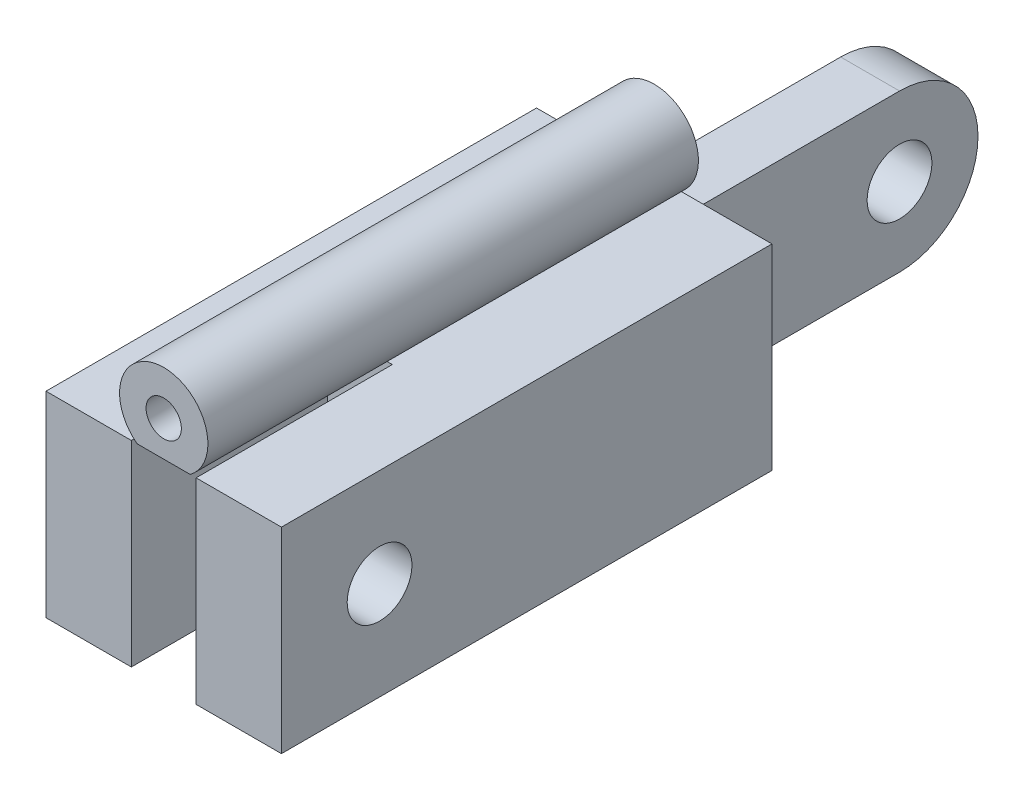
ISO-10303-21;
HEADER;
FILE_DESCRIPTION(('STEP AP214'),'2;1');
FILE_NAME('part.step','',(''),(''),'','','');
FILE_SCHEMA(('AUTOMOTIVE_DESIGN { 1 0 10303 214 1 1 1 1 }'));
ENDSEC;
DATA;
#1=APPLICATION_CONTEXT('core data for automotive mechanical design processes');
#2=APPLICATION_PROTOCOL_DEFINITION('international standard','automotive_design',2000,#1);
#3=PRODUCT_CONTEXT('',#1,'mechanical');
#4=PRODUCT('Part','Part','',(#3));
#5=PRODUCT_RELATED_PRODUCT_CATEGORY('part','',(#4));
#6=PRODUCT_DEFINITION_FORMATION('','',#4);
#7=PRODUCT_DEFINITION_CONTEXT('part definition',#1,'design');
#8=PRODUCT_DEFINITION('design','',#6,#7);
#9=PRODUCT_DEFINITION_SHAPE('','',#8);
#10=(LENGTH_UNIT() NAMED_UNIT(*) SI_UNIT(.MILLI.,.METRE.));
#11=(NAMED_UNIT(*) PLANE_ANGLE_UNIT() SI_UNIT($,.RADIAN.));
#12=(NAMED_UNIT(*) SI_UNIT($,.STERADIAN.) SOLID_ANGLE_UNIT());
#13=UNCERTAINTY_MEASURE_WITH_UNIT(LENGTH_MEASURE(1.E-05),#10,'distance_accuracy_value','');
#14=(GEOMETRIC_REPRESENTATION_CONTEXT(3) GLOBAL_UNCERTAINTY_ASSIGNED_CONTEXT((#13)) GLOBAL_UNIT_ASSIGNED_CONTEXT((#10,
#11,#12)) REPRESENTATION_CONTEXT('',''));
#15=CARTESIAN_POINT('',(0.,0.,0.));
#16=DIRECTION('',(0.,0.,1.));
#17=DIRECTION('',(1.,0.,0.));
#18=AXIS2_PLACEMENT_3D('',#15,#16,#17);
#19=CARTESIAN_POINT('',(0.,10.,0.));
#20=DIRECTION('',(0.,-1.,0.));
#21=DIRECTION('',(0.,0.,-1.));
#22=AXIS2_PLACEMENT_3D('',#19,#20,#21);
#23=PLANE('',#22);
#24=DIRECTION('',(1.,0.,0.));
#25=VECTOR('',#24,1.);
#26=CARTESIAN_POINT('',(4.35,10.,-10.));
#27=LINE('',#26,#25);
#28=CARTESIAN_POINT('',(4.35,10.,-10.));
#29=VERTEX_POINT('',#28);
#30=CARTESIAN_POINT('',(4.65,10.,-10.));
#31=VERTEX_POINT('',#30);
#32=EDGE_CURVE('E273',#29,#31,#27,.T.);
#33=ORIENTED_EDGE('',*,*,#32,.T.);
#34=DIRECTION('',(0.,0.,-1.));
#35=VECTOR('',#34,1.);
#36=CARTESIAN_POINT('',(4.65,10.,0.));
#37=LINE('',#36,#35);
#38=CARTESIAN_POINT('',(4.65,10.,-25.));
#39=VERTEX_POINT('',#38);
#40=EDGE_CURVE('E11',#31,#39,#37,.T.);
#41=ORIENTED_EDGE('',*,*,#40,.T.);
#42=DIRECTION('',(-1.,0.,0.));
#43=VECTOR('',#42,1.);
#44=CARTESIAN_POINT('',(12.,10.,-25.));
#45=LINE('',#44,#43);
#46=CARTESIAN_POINT('',(0.,10.,-25.));
#47=VERTEX_POINT('',#46);
#48=EDGE_CURVE('E285',#39,#47,#45,.T.);
#49=ORIENTED_EDGE('',*,*,#48,.T.);
#50=DIRECTION('',(0.,0.,1.));
#51=VECTOR('',#50,1.);
#52=CARTESIAN_POINT('',(0.,10.,0.));
#53=LINE('',#52,#51);
#54=CARTESIAN_POINT('',(0.,10.,0.));
#55=VERTEX_POINT('',#54);
#56=EDGE_CURVE('E261',#47,#55,#53,.T.);
#57=ORIENTED_EDGE('',*,*,#56,.T.);
#58=DIRECTION('',(1.,0.,0.));
#59=VECTOR('',#58,1.);
#60=CARTESIAN_POINT('',(0.,10.,0.));
#61=LINE('',#60,#59);
#62=CARTESIAN_POINT('',(4.35,10.,0.));
#63=VERTEX_POINT('',#62);
#64=EDGE_CURVE('E265',#55,#63,#61,.T.);
#65=ORIENTED_EDGE('',*,*,#64,.T.);
#66=DIRECTION('',(0.,0.,-1.));
#67=VECTOR('',#66,1.);
#68=CARTESIAN_POINT('',(4.35,10.,0.));
#69=LINE('',#68,#67);
#70=EDGE_CURVE('E269',#63,#29,#69,.T.);
#71=ORIENTED_EDGE('',*,*,#70,.T.);
#72=EDGE_LOOP('',(#33,#41,#49,#57,#65,#71));
#73=FACE_BOUND('',#72,.T.);
#74=ADVANCED_FACE('F45',(#73),#23,.F.);
#75=CARTESIAN_POINT('',(0.,0.,0.));
#76=DIRECTION('',(0.,-1.,0.));
#77=DIRECTION('',(0.,0.,-1.));
#78=AXIS2_PLACEMENT_3D('',#75,#76,#77);
#79=PLANE('',#78);
#80=DIRECTION('',(0.,0.,-1.));
#81=VECTOR('',#80,1.);
#82=CARTESIAN_POINT('',(4.65,0.,-10.));
#83=LINE('',#82,#81);
#84=CARTESIAN_POINT('',(4.65,0.,-10.));
#85=VERTEX_POINT('',#84);
#86=CARTESIAN_POINT('',(4.65,0.,-25.));
#87=VERTEX_POINT('',#86);
#88=EDGE_CURVE('E205',#85,#87,#83,.T.);
#89=ORIENTED_EDGE('',*,*,#88,.F.);
#90=DIRECTION('',(1.,0.,0.));
#91=VECTOR('',#90,1.);
#92=CARTESIAN_POINT('',(4.35,0.,-10.));
#93=LINE('',#92,#91);
#94=CARTESIAN_POINT('',(4.35,0.,-10.));
#95=VERTEX_POINT('',#94);
#96=EDGE_CURVE('E300',#95,#85,#93,.T.);
#97=ORIENTED_EDGE('',*,*,#96,.F.);
#98=DIRECTION('',(0.,0.,-1.));
#99=VECTOR('',#98,1.);
#100=CARTESIAN_POINT('',(4.35,0.,0.));
#101=LINE('',#100,#99);
#102=CARTESIAN_POINT('',(4.35,0.,0.));
#103=VERTEX_POINT('',#102);
#104=EDGE_CURVE('E296',#103,#95,#101,.T.);
#105=ORIENTED_EDGE('',*,*,#104,.F.);
#106=DIRECTION('',(1.,0.,0.));
#107=VECTOR('',#106,1.);
#108=CARTESIAN_POINT('',(0.,0.,0.));
#109=LINE('',#108,#107);
#110=CARTESIAN_POINT('',(0.,0.,0.));
#111=VERTEX_POINT('',#110);
#112=EDGE_CURVE('E293',#111,#103,#109,.T.);
#113=ORIENTED_EDGE('',*,*,#112,.F.);
#114=DIRECTION('',(0.,0.,1.));
#115=VECTOR('',#114,1.);
#116=CARTESIAN_POINT('',(0.,0.,0.));
#117=LINE('',#116,#115);
#118=CARTESIAN_POINT('',(0.,0.,-25.));
#119=VERTEX_POINT('',#118);
#120=EDGE_CURVE('E260',#119,#111,#117,.T.);
#121=ORIENTED_EDGE('',*,*,#120,.F.);
#122=DIRECTION('',(-1.,0.,0.));
#123=VECTOR('',#122,1.);
#124=CARTESIAN_POINT('',(0.,0.,-25.));
#125=LINE('',#124,#123);
#126=EDGE_CURVE('E314',#87,#119,#125,.T.);
#127=ORIENTED_EDGE('',*,*,#126,.F.);
#128=EDGE_LOOP('',(#89,#97,#105,#113,#121,#127));
#129=FACE_BOUND('',#128,.T.);
#130=ADVANCED_FACE('F420',(#129),#79,.T.);
#131=CARTESIAN_POINT('',(7.5,10.,-40.));
#132=DIRECTION('',(-1.,0.,0.));
#133=DIRECTION('',(0.,0.,1.));
#134=AXIS2_PLACEMENT_3D('',#131,#132,#133);
#135=PLANE('',#134);
#136=CARTESIAN_POINT('',(7.5,5.,-36.));
#137=DIRECTION('',(-1.,0.,0.));
#138=DIRECTION('',(0.,0.,1.));
#139=AXIS2_PLACEMENT_3D('',#136,#137,#138);
#140=CIRCLE('',#139,1.65);
#141=CARTESIAN_POINT('',(7.5,5.,-34.35));
#142=VERTEX_POINT('',#141);
#143=EDGE_CURVE('E236',#142,#142,#140,.T.);
#144=ORIENTED_EDGE('',*,*,#143,.T.);
#145=EDGE_LOOP('',(#144));
#146=FACE_BOUND('',#145,.T.);
#147=CARTESIAN_POINT('',(7.5,5.,-36.));
#148=DIRECTION('',(-1.,0.,0.));
#149=DIRECTION('',(0.,0.,1.));
#150=AXIS2_PLACEMENT_3D('',#147,#148,#149);
#151=CIRCLE('',#150,4.);
#152=CARTESIAN_POINT('',(7.5,1.,-36.));
#153=VERTEX_POINT('',#152);
#154=CARTESIAN_POINT('',(7.5,5.,-40.));
#155=VERTEX_POINT('',#154);
#156=EDGE_CURVE('E367',#153,#155,#151,.F.);
#157=ORIENTED_EDGE('',*,*,#156,.T.);
#158=CARTESIAN_POINT('',(7.5,5.,-36.));
#159=DIRECTION('',(-1.,0.,0.));
#160=DIRECTION('',(0.,0.,1.));
#161=AXIS2_PLACEMENT_3D('',#158,#159,#160);
#162=CIRCLE('',#161,4.);
#163=CARTESIAN_POINT('',(7.5,9.,-36.));
#164=VERTEX_POINT('',#163);
#165=EDGE_CURVE('E370',#155,#164,#162,.F.);
#166=ORIENTED_EDGE('',*,*,#165,.T.);
#167=DIRECTION('',(0.,0.,-1.));
#168=VECTOR('',#167,1.);
#169=CARTESIAN_POINT('',(7.5,9.,-40.));
#170=LINE('',#169,#168);
#171=CARTESIAN_POINT('',(7.5,9.,-25.));
#172=VERTEX_POINT('',#171);
#173=EDGE_CURVE('E256',#172,#164,#170,.T.);
#174=ORIENTED_EDGE('',*,*,#173,.F.);
#175=DIRECTION('',(0.,-1.,0.));
#176=VECTOR('',#175,1.);
#177=CARTESIAN_POINT('',(7.5,10.,-25.));
#178=LINE('',#177,#176);
#179=CARTESIAN_POINT('',(7.5,1.,-25.));
#180=VERTEX_POINT('',#179);
#181=EDGE_CURVE('E325',#172,#180,#178,.T.);
#182=ORIENTED_EDGE('',*,*,#181,.T.);
#183=DIRECTION('',(0.,0.,1.));
#184=VECTOR('',#183,1.);
#185=CARTESIAN_POINT('',(7.5,1.,-25.));
#186=LINE('',#185,#184);
#187=EDGE_CURVE('E244',#153,#180,#186,.T.);
#188=ORIENTED_EDGE('',*,*,#187,.F.);
#189=EDGE_LOOP('',(#157,#166,#174,#182,#188));
#190=FACE_BOUND('',#189,.T.);
#191=ADVANCED_FACE('F451',(#146,#190),#135,.F.);
#192=CARTESIAN_POINT('',(4.5,10.,-40.));
#193=DIRECTION('',(1.,0.,0.));
#194=DIRECTION('',(0.,0.,-1.));
#195=AXIS2_PLACEMENT_3D('',#192,#193,#194);
#196=PLANE('',#195);
#197=CARTESIAN_POINT('',(4.5,5.,-36.));
#198=DIRECTION('',(-1.,0.,0.));
#199=DIRECTION('',(0.,0.,1.));
#200=AXIS2_PLACEMENT_3D('',#197,#198,#199);
#201=CIRCLE('',#200,1.65);
#202=CARTESIAN_POINT('',(4.5,5.,-34.35));
#203=VERTEX_POINT('',#202);
#204=EDGE_CURVE('E232',#203,#203,#201,.T.);
#205=ORIENTED_EDGE('',*,*,#204,.F.);
#206=EDGE_LOOP('',(#205));
#207=FACE_BOUND('',#206,.T.);
#208=DIRECTION('',(0.,0.,1.));
#209=VECTOR('',#208,1.);
#210=CARTESIAN_POINT('',(4.5,9.,-40.));
#211=LINE('',#210,#209);
#212=CARTESIAN_POINT('',(4.5,9.,-36.));
#213=VERTEX_POINT('',#212);
#214=CARTESIAN_POINT('',(4.5,9.,-25.));
#215=VERTEX_POINT('',#214);
#216=EDGE_CURVE('E250',#213,#215,#211,.T.);
#217=ORIENTED_EDGE('',*,*,#216,.F.);
#218=CARTESIAN_POINT('',(4.5,5.,-36.));
#219=DIRECTION('',(1.,0.,0.));
#220=DIRECTION('',(0.,0.,-1.));
#221=AXIS2_PLACEMENT_3D('',#218,#219,#220);
#222=CIRCLE('',#221,4.);
#223=CARTESIAN_POINT('',(4.5,5.,-40.));
#224=VERTEX_POINT('',#223);
#225=EDGE_CURVE('E364',#213,#224,#222,.F.);
#226=ORIENTED_EDGE('',*,*,#225,.T.);
#227=CARTESIAN_POINT('',(4.5,5.,-36.));
#228=DIRECTION('',(1.,0.,0.));
#229=DIRECTION('',(0.,0.,-1.));
#230=AXIS2_PLACEMENT_3D('',#227,#228,#229);
#231=CIRCLE('',#230,4.);
#232=CARTESIAN_POINT('',(4.5,1.,-36.));
#233=VERTEX_POINT('',#232);
#234=EDGE_CURVE('E361',#224,#233,#231,.F.);
#235=ORIENTED_EDGE('',*,*,#234,.T.);
#236=DIRECTION('',(0.,0.,-1.));
#237=VECTOR('',#236,1.);
#238=CARTESIAN_POINT('',(4.5,1.,-25.));
#239=LINE('',#238,#237);
#240=CARTESIAN_POINT('',(4.5,1.,-25.));
#241=VERTEX_POINT('',#240);
#242=EDGE_CURVE('E240',#241,#233,#239,.T.);
#243=ORIENTED_EDGE('',*,*,#242,.F.);
#244=DIRECTION('',(0.,-1.,0.));
#245=VECTOR('',#244,1.);
#246=CARTESIAN_POINT('',(4.5,10.,-25.));
#247=LINE('',#246,#245);
#248=EDGE_CURVE('E321',#215,#241,#247,.T.);
#249=ORIENTED_EDGE('',*,*,#248,.F.);
#250=EDGE_LOOP('',(#217,#226,#235,#243,#249));
#251=FACE_BOUND('',#250,.T.);
#252=ADVANCED_FACE('F471',(#207,#251),#196,.F.);
#253=CARTESIAN_POINT('',(0.,10.,0.));
#254=DIRECTION('',(1.,0.,0.));
#255=DIRECTION('',(0.,0.,-1.));
#256=AXIS2_PLACEMENT_3D('',#253,#254,#255);
#257=PLANE('',#256);
#258=CARTESIAN_POINT('',(0.,5.,-5.));
#259=DIRECTION('',(-1.,0.,0.));
#260=DIRECTION('',(0.,0.,1.));
#261=AXIS2_PLACEMENT_3D('',#258,#259,#260);
#262=CIRCLE('',#261,1.65);
#263=CARTESIAN_POINT('',(0.,5.,-3.35));
#264=VERTEX_POINT('',#263);
#265=EDGE_CURVE('E212',#264,#264,#262,.T.);
#266=ORIENTED_EDGE('',*,*,#265,.F.);
#267=EDGE_LOOP('',(#266));
#268=FACE_BOUND('',#267,.T.);
#269=ORIENTED_EDGE('',*,*,#120,.T.);
#270=DIRECTION('',(0.,-1.,0.));
#271=VECTOR('',#270,1.);
#272=CARTESIAN_POINT('',(0.,10.,0.));
#273=LINE('',#272,#271);
#274=EDGE_CURVE('E353',#55,#111,#273,.T.);
#275=ORIENTED_EDGE('',*,*,#274,.F.);
#276=ORIENTED_EDGE('',*,*,#56,.F.);
#277=DIRECTION('',(0.,-1.,0.));
#278=VECTOR('',#277,1.);
#279=CARTESIAN_POINT('',(0.,10.,-25.));
#280=LINE('',#279,#278);
#281=EDGE_CURVE('E289',#47,#119,#280,.T.);
#282=ORIENTED_EDGE('',*,*,#281,.T.);
#283=EDGE_LOOP('',(#269,#275,#276,#282));
#284=FACE_BOUND('',#283,.T.);
#285=ADVANCED_FACE('F426',(#268,#284),#257,.F.);
#286=CARTESIAN_POINT('',(0.,10.,0.));
#287=DIRECTION('',(0.,0.,-1.));
#288=DIRECTION('',(-1.,0.,0.));
#289=AXIS2_PLACEMENT_3D('',#286,#287,#288);
#290=PLANE('',#289);
#291=ORIENTED_EDGE('',*,*,#112,.T.);
#292=DIRECTION('',(0.,-1.,0.));
#293=VECTOR('',#292,1.);
#294=CARTESIAN_POINT('',(4.35,10.,0.));
#295=LINE('',#294,#293);
#296=EDGE_CURVE('E349',#63,#103,#295,.T.);
#297=ORIENTED_EDGE('',*,*,#296,.F.);
#298=ORIENTED_EDGE('',*,*,#64,.F.);
#299=ORIENTED_EDGE('',*,*,#274,.T.);
#300=EDGE_LOOP('',(#291,#297,#298,#299));
#301=FACE_BOUND('',#300,.T.);
#302=ADVANCED_FACE('F430',(#301),#290,.F.);
#303=CARTESIAN_POINT('',(4.35,10.,0.));
#304=DIRECTION('',(-1.,0.,0.));
#305=DIRECTION('',(0.,0.,1.));
#306=AXIS2_PLACEMENT_3D('',#303,#304,#305);
#307=PLANE('',#306);
#308=CARTESIAN_POINT('',(4.35,5.,-5.));
#309=DIRECTION('',(-1.,0.,0.));
#310=DIRECTION('',(0.,0.,1.));
#311=AXIS2_PLACEMENT_3D('',#308,#309,#310);
#312=CIRCLE('',#311,1.65);
#313=CARTESIAN_POINT('',(4.35,5.,-3.35));
#314=VERTEX_POINT('',#313);
#315=EDGE_CURVE('E227',#314,#314,#312,.T.);
#316=ORIENTED_EDGE('',*,*,#315,.T.);
#317=EDGE_LOOP('',(#316));
#318=FACE_BOUND('',#317,.T.);
#319=ORIENTED_EDGE('',*,*,#104,.T.);
#320=DIRECTION('',(0.,-1.,0.));
#321=VECTOR('',#320,1.);
#322=CARTESIAN_POINT('',(4.35,10.,-10.));
#323=LINE('',#322,#321);
#324=EDGE_CURVE('E345',#29,#95,#323,.T.);
#325=ORIENTED_EDGE('',*,*,#324,.F.);
#326=ORIENTED_EDGE('',*,*,#70,.F.);
#327=ORIENTED_EDGE('',*,*,#296,.T.);
#328=EDGE_LOOP('',(#319,#325,#326,#327));
#329=FACE_BOUND('',#328,.T.);
#330=ADVANCED_FACE('F431',(#318,#329),#307,.F.);
#331=CARTESIAN_POINT('',(4.35,10.,-10.));
#332=DIRECTION('',(0.,0.,-1.));
#333=DIRECTION('',(-1.,0.,0.));
#334=AXIS2_PLACEMENT_3D('',#331,#332,#333);
#335=PLANE('',#334);
#336=CARTESIAN_POINT('',(6.,-1.8,-10.));
#337=DIRECTION('',(0.,0.,-1.));
#338=DIRECTION('',(-1.,0.,0.));
#339=AXIS2_PLACEMENT_3D('',#336,#337,#338);
#340=CIRCLE('',#339,0.899999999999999);
#341=CARTESIAN_POINT('',(5.1,-1.8,-10.));
#342=VERTEX_POINT('',#341);
#343=EDGE_CURVE('E198',#342,#342,#340,.T.);
#344=ORIENTED_EDGE('',*,*,#343,.T.);
#345=EDGE_LOOP('',(#344));
#346=FACE_BOUND('',#345,.T.);
#347=ORIENTED_EDGE('',*,*,#96,.T.);
#348=CARTESIAN_POINT('',(6.,-1.8,-10.));
#349=DIRECTION('',(0.,0.,-1.));
#350=DIRECTION('',(-1.,0.,0.));
#351=AXIS2_PLACEMENT_3D('',#348,#349,#350);
#352=CIRCLE('',#351,2.25);
#353=CARTESIAN_POINT('',(7.35,0.,-10.));
#354=VERTEX_POINT('',#353);
#355=EDGE_CURVE('E202',#354,#85,#352,.T.);
#356=ORIENTED_EDGE('',*,*,#355,.F.);
#357=CARTESIAN_POINT('',(7.65,0.,-10.));
#358=VERTEX_POINT('',#357);
#359=EDGE_CURVE('E299',#354,#358,#93,.T.);
#360=ORIENTED_EDGE('',*,*,#359,.T.);
#361=DIRECTION('',(0.,-1.,0.));
#362=VECTOR('',#361,1.);
#363=CARTESIAN_POINT('',(7.65,10.,-10.));
#364=LINE('',#363,#362);
#365=CARTESIAN_POINT('',(7.65,10.,-10.));
#366=VERTEX_POINT('',#365);
#367=EDGE_CURVE('E341',#366,#358,#364,.T.);
#368=ORIENTED_EDGE('',*,*,#367,.F.);
#369=CARTESIAN_POINT('',(7.35,10.,-10.));
#370=VERTEX_POINT('',#369);
#371=EDGE_CURVE('E272',#370,#366,#27,.T.);
#372=ORIENTED_EDGE('',*,*,#371,.F.);
#373=EDGE_CURVE('E67',#31,#370,#27,.T.);
#374=ORIENTED_EDGE('',*,*,#373,.F.);
#375=ORIENTED_EDGE('',*,*,#32,.F.);
#376=ORIENTED_EDGE('',*,*,#324,.T.);
#377=EDGE_LOOP('',(#347,#356,#360,#368,#372,#374,#375,#376));
#378=FACE_BOUND('',#377,.T.);
#379=ADVANCED_FACE('F387',(#346,#378),#335,.F.);
#380=CARTESIAN_POINT('',(7.65,10.,0.));
#381=DIRECTION('',(1.,0.,0.));
#382=DIRECTION('',(0.,0.,-1.));
#383=AXIS2_PLACEMENT_3D('',#380,#381,#382);
#384=PLANE('',#383);
#385=CARTESIAN_POINT('',(7.65,5.,-5.));
#386=DIRECTION('',(1.,0.,0.));
#387=DIRECTION('',(0.,0.,-1.));
#388=AXIS2_PLACEMENT_3D('',#385,#386,#387);
#389=CIRCLE('',#388,1.65);
#390=CARTESIAN_POINT('',(7.65,5.,-3.35));
#391=VERTEX_POINT('',#390);
#392=EDGE_CURVE('E220',#391,#391,#389,.T.);
#393=ORIENTED_EDGE('',*,*,#392,.T.);
#394=EDGE_LOOP('',(#393));
#395=FACE_BOUND('',#394,.T.);
#396=DIRECTION('',(0.,0.,1.));
#397=VECTOR('',#396,1.);
#398=CARTESIAN_POINT('',(7.65,0.,0.));
#399=LINE('',#398,#397);
#400=CARTESIAN_POINT('',(7.65,0.,0.));
#401=VERTEX_POINT('',#400);
#402=EDGE_CURVE('E304',#358,#401,#399,.T.);
#403=ORIENTED_EDGE('',*,*,#402,.T.);
#404=DIRECTION('',(0.,-1.,0.));
#405=VECTOR('',#404,1.);
#406=CARTESIAN_POINT('',(7.65,10.,0.));
#407=LINE('',#406,#405);
#408=CARTESIAN_POINT('',(7.65,10.,0.));
#409=VERTEX_POINT('',#408);
#410=EDGE_CURVE('E337',#409,#401,#407,.T.);
#411=ORIENTED_EDGE('',*,*,#410,.F.);
#412=DIRECTION('',(0.,0.,1.));
#413=VECTOR('',#412,1.);
#414=CARTESIAN_POINT('',(7.65,10.,0.));
#415=LINE('',#414,#413);
#416=EDGE_CURVE('E276',#366,#409,#415,.T.);
#417=ORIENTED_EDGE('',*,*,#416,.F.);
#418=ORIENTED_EDGE('',*,*,#367,.T.);
#419=EDGE_LOOP('',(#403,#411,#417,#418));
#420=FACE_BOUND('',#419,.T.);
#421=ADVANCED_FACE('F392',(#395,#420),#384,.F.);
#422=CARTESIAN_POINT('',(7.65,10.,0.));
#423=DIRECTION('',(0.,0.,-1.));
#424=DIRECTION('',(-1.,0.,0.));
#425=AXIS2_PLACEMENT_3D('',#422,#423,#424);
#426=PLANE('',#425);
#427=DIRECTION('',(1.,0.,0.));
#428=VECTOR('',#427,1.);
#429=CARTESIAN_POINT('',(7.65,0.,0.));
#430=LINE('',#429,#428);
#431=CARTESIAN_POINT('',(12.,0.,0.));
#432=VERTEX_POINT('',#431);
#433=EDGE_CURVE('E307',#401,#432,#430,.T.);
#434=ORIENTED_EDGE('',*,*,#433,.T.);
#435=DIRECTION('',(0.,-1.,0.));
#436=VECTOR('',#435,1.);
#437=CARTESIAN_POINT('',(12.,10.,0.));
#438=LINE('',#437,#436);
#439=CARTESIAN_POINT('',(12.,10.,0.));
#440=VERTEX_POINT('',#439);
#441=EDGE_CURVE('E333',#440,#432,#438,.T.);
#442=ORIENTED_EDGE('',*,*,#441,.F.);
#443=DIRECTION('',(1.,0.,0.));
#444=VECTOR('',#443,1.);
#445=CARTESIAN_POINT('',(7.65,10.,0.));
#446=LINE('',#445,#444);
#447=EDGE_CURVE('E279',#409,#440,#446,.T.);
#448=ORIENTED_EDGE('',*,*,#447,.F.);
#449=ORIENTED_EDGE('',*,*,#410,.T.);
#450=EDGE_LOOP('',(#434,#442,#448,#449));
#451=FACE_BOUND('',#450,.T.);
#452=ADVANCED_FACE('F399',(#451),#426,.F.);
#453=CARTESIAN_POINT('',(12.,10.,0.));
#454=DIRECTION('',(-1.,0.,0.));
#455=DIRECTION('',(0.,0.,1.));
#456=AXIS2_PLACEMENT_3D('',#453,#454,#455);
#457=PLANE('',#456);
#458=CARTESIAN_POINT('',(12.,5.,-5.));
#459=DIRECTION('',(-1.,0.,0.));
#460=DIRECTION('',(0.,0.,1.));
#461=AXIS2_PLACEMENT_3D('',#458,#459,#460);
#462=CIRCLE('',#461,1.65);
#463=CARTESIAN_POINT('',(12.,5.,-3.35));
#464=VERTEX_POINT('',#463);
#465=EDGE_CURVE('E216',#464,#464,#462,.T.);
#466=ORIENTED_EDGE('',*,*,#465,.T.);
#467=EDGE_LOOP('',(#466));
#468=FACE_BOUND('',#467,.T.);
#469=DIRECTION('',(0.,0.,-1.));
#470=VECTOR('',#469,1.);
#471=CARTESIAN_POINT('',(12.,0.,0.));
#472=LINE('',#471,#470);
#473=CARTESIAN_POINT('',(12.,0.,-25.));
#474=VERTEX_POINT('',#473);
#475=EDGE_CURVE('E310',#432,#474,#472,.T.);
#476=ORIENTED_EDGE('',*,*,#475,.T.);
#477=DIRECTION('',(0.,-1.,0.));
#478=VECTOR('',#477,1.);
#479=CARTESIAN_POINT('',(12.,10.,-25.));
#480=LINE('',#479,#478);
#481=CARTESIAN_POINT('',(12.,10.,-25.));
#482=VERTEX_POINT('',#481);
#483=EDGE_CURVE('E329',#482,#474,#480,.T.);
#484=ORIENTED_EDGE('',*,*,#483,.F.);
#485=DIRECTION('',(0.,0.,-1.));
#486=VECTOR('',#485,1.);
#487=CARTESIAN_POINT('',(12.,10.,0.));
#488=LINE('',#487,#486);
#489=EDGE_CURVE('E282',#440,#482,#488,.T.);
#490=ORIENTED_EDGE('',*,*,#489,.F.);
#491=ORIENTED_EDGE('',*,*,#441,.T.);
#492=EDGE_LOOP('',(#476,#484,#490,#491));
#493=FACE_BOUND('',#492,.T.);
#494=ADVANCED_FACE('F403',(#468,#493),#457,.F.);
#495=CARTESIAN_POINT('',(0.,10.,-25.));
#496=DIRECTION('',(0.,0.,1.));
#497=DIRECTION('',(1.,0.,0.));
#498=AXIS2_PLACEMENT_3D('',#495,#496,#497);
#499=PLANE('',#498);
#500=CARTESIAN_POINT('',(6.,11.8,-25.));
#501=DIRECTION('',(0.,0.,-1.));
#502=DIRECTION('',(-1.,0.,0.));
#503=AXIS2_PLACEMENT_3D('',#500,#501,#502);
#504=CIRCLE('',#503,0.899999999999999);
#505=CARTESIAN_POINT('',(5.1,11.8,-25.));
#506=VERTEX_POINT('',#505);
#507=EDGE_CURVE('E676',#506,#506,#504,.T.);
#508=ORIENTED_EDGE('',*,*,#507,.F.);
#509=EDGE_LOOP('',(#508));
#510=FACE_BOUND('',#509,.T.);
#511=CARTESIAN_POINT('',(6.,-1.8,-25.));
#512=DIRECTION('',(0.,0.,-1.));
#513=DIRECTION('',(-1.,0.,0.));
#514=AXIS2_PLACEMENT_3D('',#511,#512,#513);
#515=CIRCLE('',#514,0.899999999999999);
#516=CARTESIAN_POINT('',(5.1,-1.8,-25.));
#517=VERTEX_POINT('',#516);
#518=EDGE_CURVE('E669',#517,#517,#515,.T.);
#519=ORIENTED_EDGE('',*,*,#518,.F.);
#520=EDGE_LOOP('',(#519));
#521=FACE_BOUND('',#520,.T.);
#522=ORIENTED_EDGE('',*,*,#483,.T.);
#523=CARTESIAN_POINT('',(7.35,0.,-25.));
#524=VERTEX_POINT('',#523);
#525=EDGE_CURVE('E266',#474,#524,#125,.T.);
#526=ORIENTED_EDGE('',*,*,#525,.T.);
#527=CARTESIAN_POINT('',(6.,-1.8,-25.));
#528=DIRECTION('',(0.,0.,-1.));
#529=DIRECTION('',(-1.,0.,0.));
#530=AXIS2_PLACEMENT_3D('',#527,#528,#529);
#531=CIRCLE('',#530,2.25);
#532=EDGE_CURVE('E200',#524,#87,#531,.T.);
#533=ORIENTED_EDGE('',*,*,#532,.T.);
#534=ORIENTED_EDGE('',*,*,#126,.T.);
#535=ORIENTED_EDGE('',*,*,#281,.F.);
#536=ORIENTED_EDGE('',*,*,#48,.F.);
#537=CARTESIAN_POINT('',(6.,11.8,-25.));
#538=DIRECTION('',(0.,0.,-1.));
#539=DIRECTION('',(-1.,0.,0.));
#540=AXIS2_PLACEMENT_3D('',#537,#538,#539);
#541=CIRCLE('',#540,2.25);
#542=CARTESIAN_POINT('',(7.35,10.,-25.));
#543=VERTEX_POINT('',#542);
#544=EDGE_CURVE('E188',#39,#543,#541,.T.);
#545=ORIENTED_EDGE('',*,*,#544,.T.);
#546=EDGE_CURVE('E286',#482,#543,#45,.T.);
#547=ORIENTED_EDGE('',*,*,#546,.F.);
#548=EDGE_LOOP('',(#522,#526,#533,#534,#535,#536,#545,#547));
#549=FACE_BOUND('',#548,.T.);
#550=ORIENTED_EDGE('',*,*,#248,.T.);
#551=DIRECTION('',(-1.,0.,0.));
#552=VECTOR('',#551,1.);
#553=CARTESIAN_POINT('',(4.5,1.,-25.));
#554=LINE('',#553,#552);
#555=EDGE_CURVE('E247',#180,#241,#554,.T.);
#556=ORIENTED_EDGE('',*,*,#555,.F.);
#557=ORIENTED_EDGE('',*,*,#181,.F.);
#558=DIRECTION('',(1.,0.,0.));
#559=VECTOR('',#558,1.);
#560=CARTESIAN_POINT('',(4.5,9.,-25.));
#561=LINE('',#560,#559);
#562=EDGE_CURVE('E253',#215,#172,#561,.T.);
#563=ORIENTED_EDGE('',*,*,#562,.F.);
#564=EDGE_LOOP('',(#550,#556,#557,#563));
#565=FACE_BOUND('',#564,.T.);
#566=ADVANCED_FACE('F408',(#510,#521,#549,#565),#499,.F.);
#567=ORIENTED_EDGE('',*,*,#546,.T.);
#568=DIRECTION('',(0.,0.,-1.));
#569=VECTOR('',#568,1.);
#570=CARTESIAN_POINT('',(7.35,10.,0.));
#571=LINE('',#570,#569);
#572=EDGE_CURVE('E54',#543,#370,#571,.F.);
#573=ORIENTED_EDGE('',*,*,#572,.T.);
#574=ORIENTED_EDGE('',*,*,#371,.T.);
#575=ORIENTED_EDGE('',*,*,#416,.T.);
#576=ORIENTED_EDGE('',*,*,#447,.T.);
#577=ORIENTED_EDGE('',*,*,#489,.T.);
#578=EDGE_LOOP('',(#567,#573,#574,#575,#576,#577));
#579=FACE_BOUND('',#578,.T.);
#580=ADVANCED_FACE('F406',(#579),#23,.F.);
#581=DIRECTION('',(0.,0.,-1.));
#582=VECTOR('',#581,1.);
#583=CARTESIAN_POINT('',(7.35,0.,-10.));
#584=LINE('',#583,#582);
#585=EDGE_CURVE('E208',#354,#524,#584,.T.);
#586=ORIENTED_EDGE('',*,*,#585,.T.);
#587=ORIENTED_EDGE('',*,*,#525,.F.);
#588=ORIENTED_EDGE('',*,*,#475,.F.);
#589=ORIENTED_EDGE('',*,*,#433,.F.);
#590=ORIENTED_EDGE('',*,*,#402,.F.);
#591=ORIENTED_EDGE('',*,*,#359,.F.);
#592=EDGE_LOOP('',(#586,#587,#588,#589,#590,#591));
#593=FACE_BOUND('',#592,.T.);
#594=ADVANCED_FACE('F395',(#593),#79,.T.);
#595=CARTESIAN_POINT('',(0.,9.,0.));
#596=DIRECTION('',(0.,1.,0.));
#597=DIRECTION('',(0.,0.,1.));
#598=AXIS2_PLACEMENT_3D('',#595,#596,#597);
#599=PLANE('',#598);
#600=ORIENTED_EDGE('',*,*,#173,.T.);
#601=DIRECTION('',(-1.,0.,0.));
#602=VECTOR('',#601,1.);
#603=CARTESIAN_POINT('',(4.5,9.,-36.));
#604=LINE('',#603,#602);
#605=EDGE_CURVE('E357',#164,#213,#604,.T.);
#606=ORIENTED_EDGE('',*,*,#605,.T.);
#607=ORIENTED_EDGE('',*,*,#216,.T.);
#608=ORIENTED_EDGE('',*,*,#562,.T.);
#609=EDGE_LOOP('',(#600,#606,#607,#608));
#610=FACE_BOUND('',#609,.T.);
#611=ADVANCED_FACE('F458',(#610),#599,.T.);
#612=CARTESIAN_POINT('',(0.,1.,0.));
#613=DIRECTION('',(0.,-1.,0.));
#614=DIRECTION('',(0.,0.,-1.));
#615=AXIS2_PLACEMENT_3D('',#612,#613,#614);
#616=PLANE('',#615);
#617=ORIENTED_EDGE('',*,*,#242,.T.);
#618=DIRECTION('',(1.,0.,0.));
#619=VECTOR('',#618,1.);
#620=CARTESIAN_POINT('',(7.5,1.,-36.));
#621=LINE('',#620,#619);
#622=EDGE_CURVE('E373',#233,#153,#621,.T.);
#623=ORIENTED_EDGE('',*,*,#622,.T.);
#624=ORIENTED_EDGE('',*,*,#187,.T.);
#625=ORIENTED_EDGE('',*,*,#555,.T.);
#626=EDGE_LOOP('',(#617,#623,#624,#625));
#627=FACE_BOUND('',#626,.T.);
#628=ADVANCED_FACE('F504',(#627),#616,.T.);
#629=CARTESIAN_POINT('',(14.5,5.,-36.));
#630=DIRECTION('',(-1.,0.,0.));
#631=DIRECTION('',(0.,0.,1.));
#632=AXIS2_PLACEMENT_3D('',#629,#630,#631);
#633=CYLINDRICAL_SURFACE('',#632,1.65);
#634=ORIENTED_EDGE('',*,*,#204,.T.);
#635=EDGE_LOOP('',(#634));
#636=FACE_BOUND('',#635,.T.);
#637=ORIENTED_EDGE('',*,*,#143,.F.);
#638=EDGE_LOOP('',(#637));
#639=FACE_BOUND('',#638,.T.);
#640=ADVANCED_FACE('F501',(#636,#639),#633,.F.);
#641=CARTESIAN_POINT('',(0.,5.,-36.));
#642=DIRECTION('',(-1.,0.,0.));
#643=DIRECTION('',(0.,0.,1.));
#644=AXIS2_PLACEMENT_3D('',#641,#642,#643);
#645=CYLINDRICAL_SURFACE('',#644,4.);
#646=DIRECTION('',(1.,0.,0.));
#647=VECTOR('',#646,1.);
#648=CARTESIAN_POINT('',(4.5,5.,-40.));
#649=LINE('',#648,#647);
#650=EDGE_CURVE('E231',#155,#224,#649,.F.);
#651=ORIENTED_EDGE('',*,*,#650,.F.);
#652=ORIENTED_EDGE('',*,*,#156,.F.);
#653=ORIENTED_EDGE('',*,*,#622,.F.);
#654=ORIENTED_EDGE('',*,*,#234,.F.);
#655=EDGE_LOOP('',(#651,#652,#653,#654));
#656=FACE_BOUND('',#655,.T.);
#657=ADVANCED_FACE('F47',(#656),#645,.T.);
#658=CARTESIAN_POINT('',(0.,5.,-36.));
#659=DIRECTION('',(1.,0.,0.));
#660=DIRECTION('',(0.,0.,-1.));
#661=AXIS2_PLACEMENT_3D('',#658,#659,#660);
#662=CYLINDRICAL_SURFACE('',#661,4.);
#663=ORIENTED_EDGE('',*,*,#165,.F.);
#664=ORIENTED_EDGE('',*,*,#650,.T.);
#665=ORIENTED_EDGE('',*,*,#225,.F.);
#666=ORIENTED_EDGE('',*,*,#605,.F.);
#667=EDGE_LOOP('',(#663,#664,#665,#666));
#668=FACE_BOUND('',#667,.T.);
#669=ADVANCED_FACE('F488',(#668),#662,.T.);
#670=CARTESIAN_POINT('',(12.,5.,-5.));
#671=DIRECTION('',(-1.,0.,0.));
#672=DIRECTION('',(0.,0.,1.));
#673=AXIS2_PLACEMENT_3D('',#670,#671,#672);
#674=CYLINDRICAL_SURFACE('',#673,1.65);
#675=CARTESIAN_POINT('',(12.,5.,-3.35));
#676=CARTESIAN_POINT('',(11.9546875,5.,-3.35));
#677=CARTESIAN_POINT('',(11.909375,5.,-3.35));
#678=CARTESIAN_POINT('',(11.81875,5.,-3.35));
#679=CARTESIAN_POINT('',(11.7734375,5.,-3.35));
#680=CARTESIAN_POINT('',(11.6828125,5.,-3.35));
#681=CARTESIAN_POINT('',(11.6375,5.,-3.35));
#682=CARTESIAN_POINT('',(11.546875,5.,-3.35));
#683=CARTESIAN_POINT('',(11.5015625,5.,-3.35));
#684=CARTESIAN_POINT('',(11.4109375,5.,-3.35));
#685=CARTESIAN_POINT('',(11.365625,5.,-3.35));
#686=CARTESIAN_POINT('',(11.275,5.,-3.35));
#687=CARTESIAN_POINT('',(11.2296875,5.,-3.35));
#688=CARTESIAN_POINT('',(11.1390625,5.,-3.35));
#689=CARTESIAN_POINT('',(11.09375,5.,-3.35));
#690=CARTESIAN_POINT('',(11.003125,5.,-3.35));
#691=CARTESIAN_POINT('',(10.9578125,5.,-3.35));
#692=CARTESIAN_POINT('',(10.8671875,5.,-3.35));
#693=CARTESIAN_POINT('',(10.821875,5.,-3.35));
#694=CARTESIAN_POINT('',(10.73125,5.,-3.35));
#695=CARTESIAN_POINT('',(10.6859375,5.,-3.35));
#696=CARTESIAN_POINT('',(10.5953125,5.,-3.35));
#697=CARTESIAN_POINT('',(10.55,5.,-3.35));
#698=CARTESIAN_POINT('',(10.459375,5.,-3.35));
#699=CARTESIAN_POINT('',(10.4140625,5.,-3.35));
#700=CARTESIAN_POINT('',(10.3234375,5.,-3.35));
#701=CARTESIAN_POINT('',(10.278125,5.,-3.35));
#702=CARTESIAN_POINT('',(10.1875,5.,-3.35));
#703=CARTESIAN_POINT('',(10.1421875,5.,-3.35));
#704=CARTESIAN_POINT('',(10.0515625,5.,-3.35));
#705=CARTESIAN_POINT('',(10.00625,5.,-3.35));
#706=CARTESIAN_POINT('',(9.915625,5.,-3.35));
#707=CARTESIAN_POINT('',(9.8703125,5.,-3.35));
#708=CARTESIAN_POINT('',(9.7796875,5.,-3.35));
#709=CARTESIAN_POINT('',(9.734375,5.,-3.35));
#710=CARTESIAN_POINT('',(9.64375,5.,-3.35));
#711=CARTESIAN_POINT('',(9.5984375,5.,-3.35));
#712=CARTESIAN_POINT('',(9.5078125,5.,-3.35));
#713=CARTESIAN_POINT('',(9.4625,5.,-3.35));
#714=CARTESIAN_POINT('',(9.371875,5.,-3.35));
#715=CARTESIAN_POINT('',(9.3265625,5.,-3.35));
#716=CARTESIAN_POINT('',(9.2359375,5.,-3.35));
#717=CARTESIAN_POINT('',(9.190625,5.,-3.35));
#718=CARTESIAN_POINT('',(9.1,5.,-3.35));
#719=CARTESIAN_POINT('',(9.0546875,5.,-3.35));
#720=CARTESIAN_POINT('',(8.9640625,5.,-3.35));
#721=CARTESIAN_POINT('',(8.91875,5.,-3.35));
#722=CARTESIAN_POINT('',(8.828125,5.,-3.35));
#723=CARTESIAN_POINT('',(8.7828125,5.,-3.35));
#724=CARTESIAN_POINT('',(8.6921875,5.,-3.35));
#725=CARTESIAN_POINT('',(8.646875,5.,-3.35));
#726=CARTESIAN_POINT('',(8.55625,5.,-3.35));
#727=CARTESIAN_POINT('',(8.5109375,5.,-3.35));
#728=CARTESIAN_POINT('',(8.4203125,5.,-3.35));
#729=CARTESIAN_POINT('',(8.375,5.,-3.35));
#730=CARTESIAN_POINT('',(8.284375,5.,-3.35));
#731=CARTESIAN_POINT('',(8.2390625,5.,-3.35));
#732=CARTESIAN_POINT('',(8.1484375,5.,-3.35));
#733=CARTESIAN_POINT('',(8.103125,5.,-3.35));
#734=CARTESIAN_POINT('',(8.0125,5.,-3.35));
#735=CARTESIAN_POINT('',(7.9671875,5.,-3.35));
#736=CARTESIAN_POINT('',(7.8765625,5.,-3.35));
#737=CARTESIAN_POINT('',(7.83125,5.,-3.35));
#738=CARTESIAN_POINT('',(7.740625,5.,-3.35));
#739=CARTESIAN_POINT('',(7.6953125,5.,-3.35));
#740=CARTESIAN_POINT('',(7.65,5.,-3.35));
#741=B_SPLINE_CURVE_WITH_KNOTS('',3,(#675,#676,#677,#678,#679,#680,#681,#682,#683,#684,#685,
#686,#687,#688,#689,#690,#691,#692,#693,#694,#695,#696,#697,#698,#699,#700,#701,#702,#703,#704,
#705,#706,#707,#708,#709,#710,#711,#712,#713,#714,#715,#716,#717,#718,#719,#720,#721,#722,#723,
#724,#725,#726,#727,#728,#729,#730,#731,#732,#733,#734,#735,#736,#737,#738,#739,#740),
.UNSPECIFIED.,.F.,.F.,(4,2,2,2,2,2,2,2,2,2,2,2,2,2,2,2,2,2,2,2,2,2,2,2,2,2,2,2,2,2,2,2,4),(0.,
0.135937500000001,0.271875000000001,0.4078125,0.543750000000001,0.679687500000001,0.815625,
0.951562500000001,1.0875,1.2234375,1.359375,1.4953125,1.63125,1.7671875,1.903125,2.0390625,
2.175,2.3109375,2.446875,2.5828125,2.71875,2.8546875,2.990625,3.1265625,3.2625,3.3984375,
3.534375,3.6703125,3.80625,3.9421875,4.078125,4.2140625,4.35),.UNSPECIFIED.);
#742=EDGE_CURVE('BSEAM485',#464,#391,#741,.T.);
#743=ORIENTED_EDGE('',*,*,#465,.F.);
#744=ORIENTED_EDGE('',*,*,#392,.F.);
#745=ORIENTED_EDGE('',*,*,#742,.T.);
#746=ORIENTED_EDGE('',*,*,#742,.F.);
#747=EDGE_LOOP('',(#743,#745,#744,#746));
#748=FACE_BOUND('',#747,.T.);
#749=ADVANCED_FACE('F485',(#748),#674,.F.);
#750=CARTESIAN_POINT('',(0.,5.,-3.35));
#751=CARTESIAN_POINT('',(0.0453125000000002,5.,-3.35));
#752=CARTESIAN_POINT('',(0.0906250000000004,5.,-3.35));
#753=CARTESIAN_POINT('',(0.18125,5.,-3.35));
#754=CARTESIAN_POINT('',(0.2265625,5.,-3.35));
#755=CARTESIAN_POINT('',(0.3171875,5.,-3.35));
#756=CARTESIAN_POINT('',(0.3625,5.,-3.35));
#757=CARTESIAN_POINT('',(0.453125,5.,-3.35));
#758=CARTESIAN_POINT('',(0.498437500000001,5.,-3.35));
#759=CARTESIAN_POINT('',(0.5890625,5.,-3.35));
#760=CARTESIAN_POINT('',(0.634375,5.,-3.35));
#761=CARTESIAN_POINT('',(0.725,5.,-3.35));
#762=CARTESIAN_POINT('',(0.7703125,5.,-3.35));
#763=CARTESIAN_POINT('',(0.860937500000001,5.,-3.35));
#764=CARTESIAN_POINT('',(0.906250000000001,5.,-3.35));
#765=CARTESIAN_POINT('',(0.996875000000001,5.,-3.35));
#766=CARTESIAN_POINT('',(1.0421875,5.,-3.35));
#767=CARTESIAN_POINT('',(1.1328125,5.,-3.35));
#768=CARTESIAN_POINT('',(1.178125,5.,-3.35));
#769=CARTESIAN_POINT('',(1.26875,5.,-3.35));
#770=CARTESIAN_POINT('',(1.3140625,5.,-3.35));
#771=CARTESIAN_POINT('',(1.4046875,5.,-3.35));
#772=CARTESIAN_POINT('',(1.45,5.,-3.35));
#773=CARTESIAN_POINT('',(1.540625,5.,-3.35));
#774=CARTESIAN_POINT('',(1.5859375,5.,-3.35));
#775=CARTESIAN_POINT('',(1.6765625,5.,-3.35));
#776=CARTESIAN_POINT('',(1.721875,5.,-3.35));
#777=CARTESIAN_POINT('',(1.8125,5.,-3.35));
#778=CARTESIAN_POINT('',(1.8578125,5.,-3.35));
#779=CARTESIAN_POINT('',(1.9484375,5.,-3.35));
#780=CARTESIAN_POINT('',(1.99375,5.,-3.35));
#781=CARTESIAN_POINT('',(2.084375,5.,-3.35));
#782=CARTESIAN_POINT('',(2.1296875,5.,-3.35));
#783=CARTESIAN_POINT('',(2.2203125,5.,-3.35));
#784=CARTESIAN_POINT('',(2.265625,5.,-3.35));
#785=CARTESIAN_POINT('',(2.35625,5.,-3.35));
#786=CARTESIAN_POINT('',(2.4015625,5.,-3.35));
#787=CARTESIAN_POINT('',(2.4921875,5.,-3.35));
#788=CARTESIAN_POINT('',(2.5375,5.,-3.35));
#789=CARTESIAN_POINT('',(2.628125,5.,-3.35));
#790=CARTESIAN_POINT('',(2.6734375,5.,-3.35));
#791=CARTESIAN_POINT('',(2.7640625,5.,-3.35));
#792=CARTESIAN_POINT('',(2.809375,5.,-3.35));
#793=CARTESIAN_POINT('',(2.9,5.,-3.35));
#794=CARTESIAN_POINT('',(2.9453125,5.,-3.35));
#795=CARTESIAN_POINT('',(3.0359375,5.,-3.35));
#796=CARTESIAN_POINT('',(3.08125,5.,-3.35));
#797=CARTESIAN_POINT('',(3.171875,5.,-3.35));
#798=CARTESIAN_POINT('',(3.2171875,5.,-3.35));
#799=CARTESIAN_POINT('',(3.3078125,5.,-3.35));
#800=CARTESIAN_POINT('',(3.353125,5.,-3.35));
#801=CARTESIAN_POINT('',(3.44375,5.,-3.35));
#802=CARTESIAN_POINT('',(3.4890625,5.,-3.35));
#803=CARTESIAN_POINT('',(3.5796875,5.,-3.35));
#804=CARTESIAN_POINT('',(3.625,5.,-3.35));
#805=CARTESIAN_POINT('',(3.715625,5.,-3.35));
#806=CARTESIAN_POINT('',(3.7609375,5.,-3.35));
#807=CARTESIAN_POINT('',(3.8515625,5.,-3.35));
#808=CARTESIAN_POINT('',(3.896875,5.,-3.35));
#809=CARTESIAN_POINT('',(3.9875,5.,-3.35));
#810=CARTESIAN_POINT('',(4.0328125,5.,-3.35));
#811=CARTESIAN_POINT('',(4.1234375,5.,-3.35));
#812=CARTESIAN_POINT('',(4.16875,5.,-3.35));
#813=CARTESIAN_POINT('',(4.259375,5.,-3.35));
#814=CARTESIAN_POINT('',(4.3046875,5.,-3.35));
#815=CARTESIAN_POINT('',(4.35,5.,-3.35));
#816=B_SPLINE_CURVE_WITH_KNOTS('',3,(#750,#751,#752,#753,#754,#755,#756,#757,#758,#759,#760,
#761,#762,#763,#764,#765,#766,#767,#768,#769,#770,#771,#772,#773,#774,#775,#776,#777,#778,#779,
#780,#781,#782,#783,#784,#785,#786,#787,#788,#789,#790,#791,#792,#793,#794,#795,#796,#797,#798,
#799,#800,#801,#802,#803,#804,#805,#806,#807,#808,#809,#810,#811,#812,#813,#814,#815),
.UNSPECIFIED.,.F.,.F.,(4,2,2,2,2,2,2,2,2,2,2,2,2,2,2,2,2,2,2,2,2,2,2,2,2,2,2,2,2,2,2,2,4),(0.,
0.135937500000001,0.271875,0.4078125,0.543750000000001,0.6796875,0.815625,0.951562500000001,
1.0875,1.2234375,1.359375,1.4953125,1.63125,1.7671875,1.903125,2.0390625,2.175,2.3109375,
2.446875,2.5828125,2.71875,2.8546875,2.990625,3.1265625,3.2625,3.3984375,3.534375,3.6703125,
3.80625,3.9421875,4.078125,4.2140625,4.35),.UNSPECIFIED.);
#817=EDGE_CURVE('BSEAM487',#264,#314,#816,.T.);
#818=ORIENTED_EDGE('',*,*,#265,.T.);
#819=ORIENTED_EDGE('',*,*,#315,.F.);
#820=ORIENTED_EDGE('',*,*,#817,.T.);
#821=ORIENTED_EDGE('',*,*,#817,.F.);
#822=EDGE_LOOP('',(#818,#820,#819,#821));
#823=FACE_BOUND('',#822,.T.);
#824=ADVANCED_FACE('F487',(#823),#674,.F.);
#825=CARTESIAN_POINT('',(6.,-1.8,-10.));
#826=DIRECTION('',(0.,0.,-1.));
#827=DIRECTION('',(-1.,0.,0.));
#828=AXIS2_PLACEMENT_3D('',#825,#826,#827);
#829=CYLINDRICAL_SURFACE('',#828,2.25);
#830=ORIENTED_EDGE('',*,*,#532,.F.);
#831=ORIENTED_EDGE('',*,*,#585,.F.);
#832=ORIENTED_EDGE('',*,*,#355,.T.);
#833=ORIENTED_EDGE('',*,*,#88,.T.);
#834=EDGE_LOOP('',(#830,#831,#832,#833));
#835=FACE_BOUND('',#834,.T.);
#836=ADVANCED_FACE('F424',(#835),#829,.T.);
#837=CARTESIAN_POINT('',(7.35,10.,0.));
#838=DIRECTION('',(0.,-1.,0.));
#839=DIRECTION('',(0.,0.,-1.));
#840=AXIS2_PLACEMENT_3D('',#837,#838,#839);
#841=PLANE('',#840);
#842=ORIENTED_EDGE('',*,*,#373,.T.);
#843=DIRECTION('',(0.,0.,-1.));
#844=VECTOR('',#843,1.);
#845=CARTESIAN_POINT('',(7.35,10.,0.));
#846=LINE('',#845,#844);
#847=CARTESIAN_POINT('',(7.35,10.,0.));
#848=VERTEX_POINT('',#847);
#849=EDGE_CURVE('E171',#848,#370,#846,.T.);
#850=ORIENTED_EDGE('',*,*,#849,.F.);
#851=DIRECTION('',(-1.,0.,0.));
#852=VECTOR('',#851,1.);
#853=CARTESIAN_POINT('',(7.35,10.,0.));
#854=LINE('',#853,#852);
#855=CARTESIAN_POINT('',(4.65,10.,0.));
#856=VERTEX_POINT('',#855);
#857=EDGE_CURVE('E176',#848,#856,#854,.T.);
#858=ORIENTED_EDGE('',*,*,#857,.T.);
#859=DIRECTION('',(0.,0.,-1.));
#860=VECTOR('',#859,1.);
#861=CARTESIAN_POINT('',(4.65,10.,0.));
#862=LINE('',#861,#860);
#863=EDGE_CURVE('E179',#856,#31,#862,.T.);
#864=ORIENTED_EDGE('',*,*,#863,.T.);
#865=EDGE_LOOP('',(#842,#850,#858,#864));
#866=FACE_BOUND('',#865,.T.);
#867=ADVANCED_FACE('F173',(#866),#841,.T.);
#868=CARTESIAN_POINT('',(6.,11.8,0.));
#869=DIRECTION('',(0.,0.,-1.));
#870=DIRECTION('',(-1.,0.,0.));
#871=AXIS2_PLACEMENT_3D('',#868,#869,#870);
#872=CYLINDRICAL_SURFACE('',#871,2.25);
#873=ORIENTED_EDGE('',*,*,#544,.F.);
#874=ORIENTED_EDGE('',*,*,#40,.F.);
#875=ORIENTED_EDGE('',*,*,#863,.F.);
#876=CARTESIAN_POINT('',(6.,11.8,0.));
#877=DIRECTION('',(0.,0.,-1.));
#878=DIRECTION('',(-1.,0.,0.));
#879=AXIS2_PLACEMENT_3D('',#876,#877,#878);
#880=CIRCLE('',#879,2.25);
#881=EDGE_CURVE('E182',#856,#848,#880,.T.);
#882=ORIENTED_EDGE('',*,*,#881,.T.);
#883=ORIENTED_EDGE('',*,*,#849,.T.);
#884=ORIENTED_EDGE('',*,*,#572,.F.);
#885=EDGE_LOOP('',(#873,#874,#875,#882,#883,#884));
#886=FACE_BOUND('',#885,.T.);
#887=ADVANCED_FACE('F184',(#886),#872,.T.);
#888=CARTESIAN_POINT('',(6.,11.8,0.));
#889=DIRECTION('',(0.,0.,-1.));
#890=DIRECTION('',(-1.,0.,0.));
#891=AXIS2_PLACEMENT_3D('',#888,#889,#890);
#892=PLANE('',#891);
#893=CARTESIAN_POINT('',(6.,11.8,0.));
#894=DIRECTION('',(0.,0.,-1.));
#895=DIRECTION('',(-1.,0.,0.));
#896=AXIS2_PLACEMENT_3D('',#893,#894,#895);
#897=CIRCLE('',#896,0.899999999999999);
#898=CARTESIAN_POINT('',(5.1,11.8,0.));
#899=VERTEX_POINT('',#898);
#900=EDGE_CURVE('E673',#899,#899,#897,.T.);
#901=ORIENTED_EDGE('',*,*,#900,.T.);
#902=EDGE_LOOP('',(#901));
#903=FACE_BOUND('',#902,.T.);
#904=ORIENTED_EDGE('',*,*,#881,.F.);
#905=ORIENTED_EDGE('',*,*,#857,.F.);
#906=EDGE_LOOP('',(#904,#905));
#907=FACE_BOUND('',#906,.T.);
#908=ADVANCED_FACE('F190',(#903,#907),#892,.F.);
#909=CARTESIAN_POINT('',(6.,11.8,0.));
#910=DIRECTION('',(0.,0.,-1.));
#911=DIRECTION('',(-1.,0.,0.));
#912=AXIS2_PLACEMENT_3D('',#909,#910,#911);
#913=CYLINDRICAL_SURFACE('',#912,0.899999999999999);
#914=ORIENTED_EDGE('',*,*,#900,.F.);
#915=EDGE_LOOP('',(#914));
#916=FACE_BOUND('',#915,.T.);
#917=ORIENTED_EDGE('',*,*,#507,.T.);
#918=EDGE_LOOP('',(#917));
#919=FACE_BOUND('',#918,.T.);
#920=ADVANCED_FACE('F643',(#916,#919),#913,.F.);
#921=CARTESIAN_POINT('',(6.,-1.8,0.));
#922=DIRECTION('',(0.,0.,-1.));
#923=DIRECTION('',(-1.,0.,0.));
#924=AXIS2_PLACEMENT_3D('',#921,#922,#923);
#925=CYLINDRICAL_SURFACE('',#924,0.899999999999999);
#926=ORIENTED_EDGE('',*,*,#518,.T.);
#927=EDGE_LOOP('',(#926));
#928=FACE_BOUND('',#927,.T.);
#929=ORIENTED_EDGE('',*,*,#343,.F.);
#930=EDGE_LOOP('',(#929));
#931=FACE_BOUND('',#930,.T.);
#932=ADVANCED_FACE('F653',(#928,#931),#925,.F.);
#933=CLOSED_SHELL('',(#74,#130,#191,#252,#285,#302,#330,#379,#421,#452,#494,#566,#580,#594,#611,
#628,#640,#657,#669,#749,#824,#836,#867,#887,#908,#920,#932));
#934=MANIFOLD_SOLID_BREP('B2',#933);
#935=ADVANCED_BREP_SHAPE_REPRESENTATION('',(#18,#934),#14);
#936=SHAPE_DEFINITION_REPRESENTATION(#9,#935);
ENDSEC;
END-ISO-10303-21;
